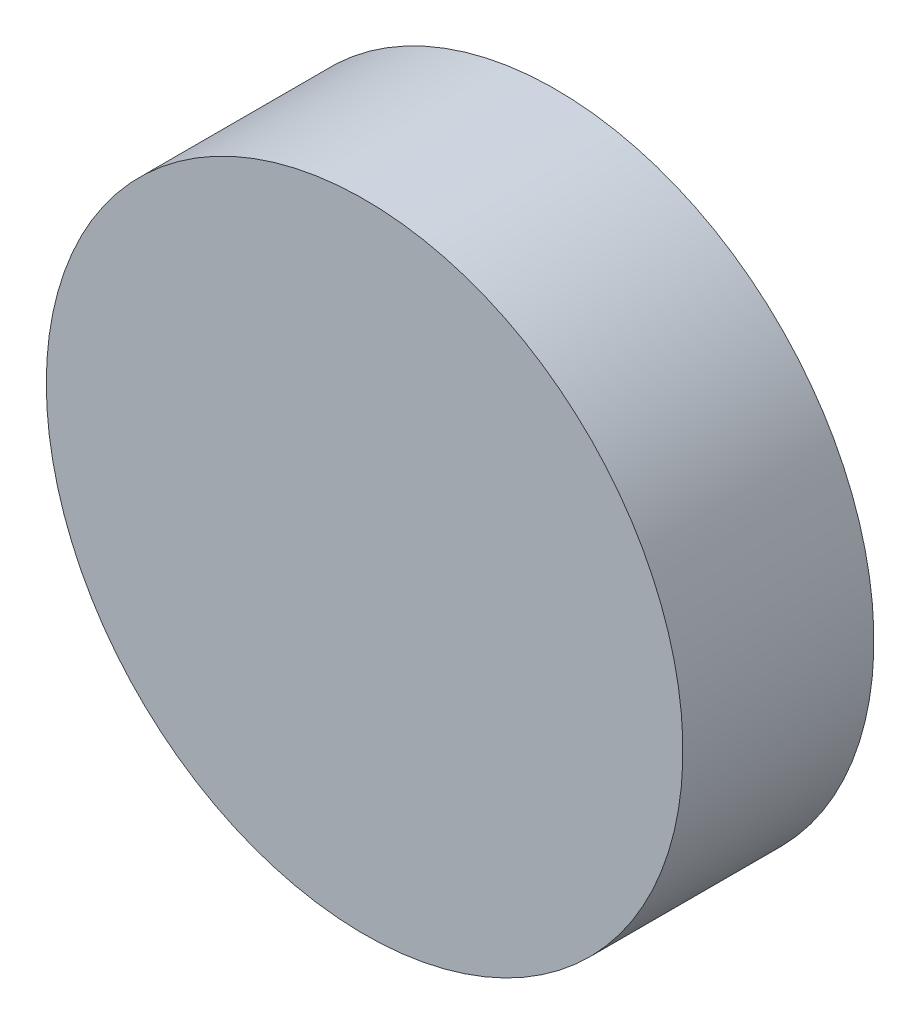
from build123d import *

# Parameters (mm, degrees)
SKETCH2_R          = 15.875
BASE_EXTRUDE_DEPTH = 9.525


with BuildPart() as part:
    # Sketch2 → Base-Extrude (new body)
    with BuildSketch(Plane.XY):
        with Locations(Location((0, 0, 0), (0, 0, 180))):
            Circle(SKETCH2_R)
    extrude(amount=BASE_EXTRUDE_DEPTH)


solid = part.part
